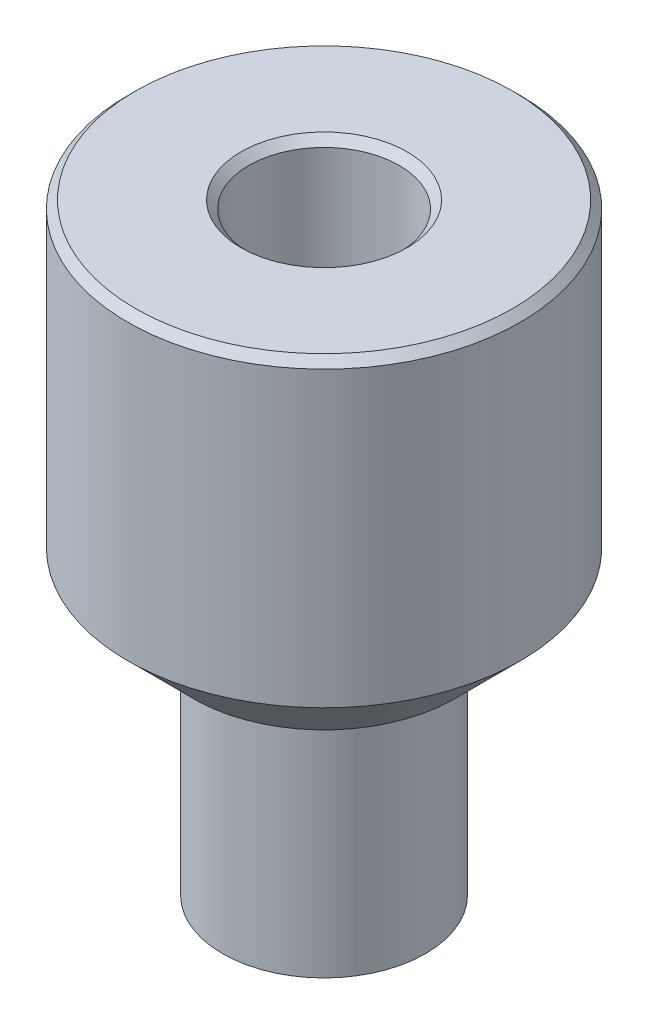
from build123d import *

# Parameters (mm, degrees)
ENL_V_MAT_EXTRU_1_DEPTH = 8
CHANFREIN1_SIZE         = 0.6


with BuildPart() as part:
    # Esquisse2 → R_volution1 (revolve)
    with BuildSketch(Plane.XY, mode=Mode.PRIVATE) as r_volution1_sk:
        with BuildLine():
            Line((-15, 46), (-5.75, 46))
            Line((-5.75, 46), (-5.75, 23.5))
            ThreePointArc((-5.75, 23.5), (-5.310660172, 22.439339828), (-4.25, 22))
            Line((-4.25, 22), (0, 22))
            Line((0, 22), (0, 0))
            Line((0, 0), (-7.75, 0))
            Line((-7.75, 0), (-7.75, 17.4))
            ThreePointArc((-7.75, 17.4), (-7.925735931, 17.824264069), (-8.35, 18))
            Line((-8.35, 18), (-10, 18))
            Line((-10, 18), (-15, 23))
            Line((-15, 23), (-15, 46))
        make_face()
    revolve(r_volution1_sk.sketch.rotate(Axis((0, 0, 0), (0, 1, 0)), 270), axis=Axis((0, 0, 0), (0, 1, 0)))

    # Esquisse3 → Enl_v. mat.-Extru.1 (cut)
    with BuildSketch(Plane.XZ):
        with BuildLine():
            Line((-1.6, -2.049390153), (-1.6, 2.049390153))
            ThreePointArc((-1.6, 2.049390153), (0, 2.6), (1.6, 2.049390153))
            Line((1.6, 2.049390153), (1.6, -2.049390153))
            ThreePointArc((1.6, -2.049390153), (0, -2.6), (-1.6, -2.049390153))
        make_face()
    extrude(amount=-ENL_V_MAT_EXTRU_1_DEPTH, mode=Mode.SUBTRACT)

    # Chanfrein1
    chanfrein1_edges = [part.edges().sort_by_distance(p)[0] for p in [
        (0, 46, 5.75),
        (0, 46, 15),
    ]]
    chamfer(chanfrein1_edges, length=CHANFREIN1_SIZE)


solid = part.part
